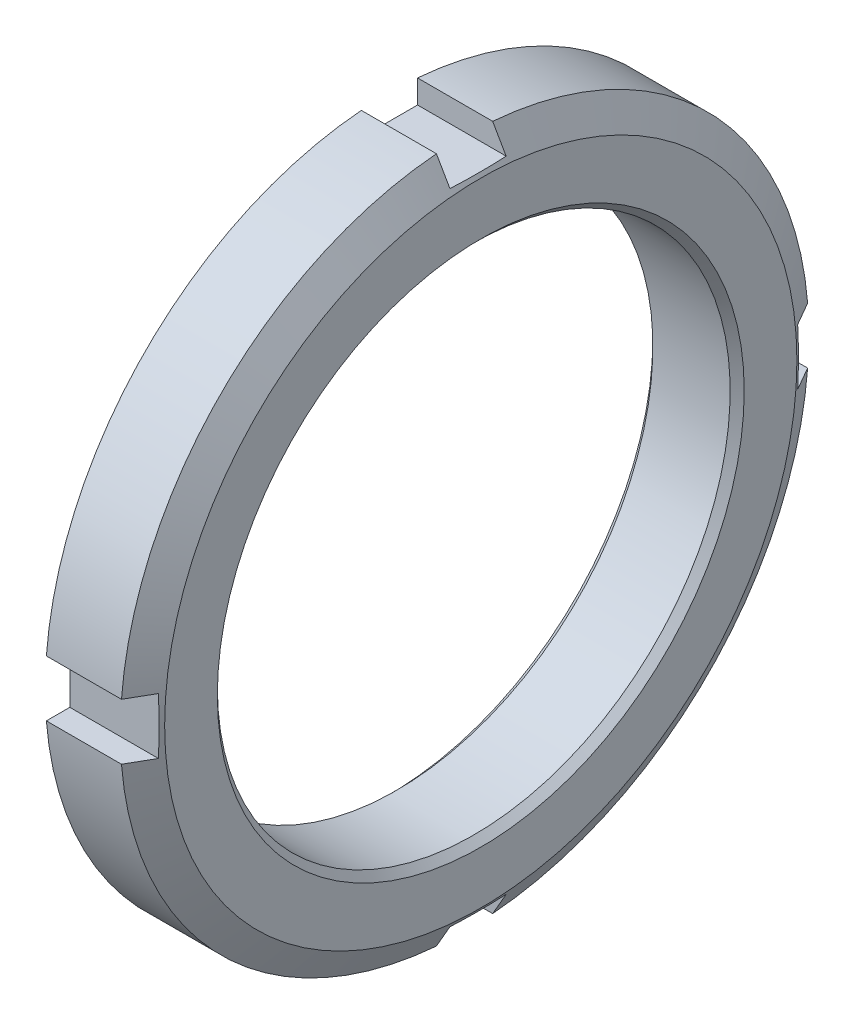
from build123d import *

# Parameters (mm, degrees)
ESQUISSE3_W             = 150
ESQUISSE3_H             = 150
ENL_V_MAT_EXTRU_1_DEPTH = 13


with BuildPart() as part:
    # Esquisse1 → R_volution1 (revolve)
    with BuildSketch(Plane.XY, mode=Mode.PRIVATE) as r_volution1_sk:
        Polygon((0, 0), (0, 49), (10.690598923, 49), (13, 45), (13, 0), align=None)
    revolve(r_volution1_sk.sketch.rotate(Axis((13, 0, 0), (-1, 0, 0)), 270), axis=Axis((13, 0, 0), (-1, 0, 0)))

    # Esquisse2 → Enl_vement de mati_re-R_volution1 (revolve, cut)
    with BuildSketch(Plane.XY, mode=Mode.PRIVATE) as enl_vement_de_mati_re_r_volution1_sk:
        Polygon((0, 0), (0, 37.5), (1, 36.5), (12, 36.5), (13, 37.5), (13, 0), align=None)
    revolve(enl_vement_de_mati_re_r_volution1_sk.sketch.rotate(Axis((13, 0, 0), (-1, 0, 0)), 270), axis=Axis((13, 0, 0), (-1, 0, 0)), mode=Mode.SUBTRACT)

    # Esquisse3 → Enl_v. mat.-Extru.1 (cut)
    with BuildSketch(Plane(origin=(0, 0, 0), x_dir=(0, 0, -1), z_dir=(1, 0, 0))):
        Rectangle(ESQUISSE3_W, ESQUISSE3_H)
        Polygon((-49, 4), (-45.5, 4), (-45.5, -4), (-49, -4), (-49, -49), (-4, -49), (-4, -45.5), (4, -45.5), (4, -49), (49, -49), (49, -4), (45.5, -4), (45.5, 4), (49, 4), (49, 49), (4, 49), (4, 45.5), (-4, 45.5), (-4, 49), (-49, 49), align=None, mode=Mode.SUBTRACT)
    extrude(amount=ENL_V_MAT_EXTRU_1_DEPTH, mode=Mode.SUBTRACT)


solid = part.part
